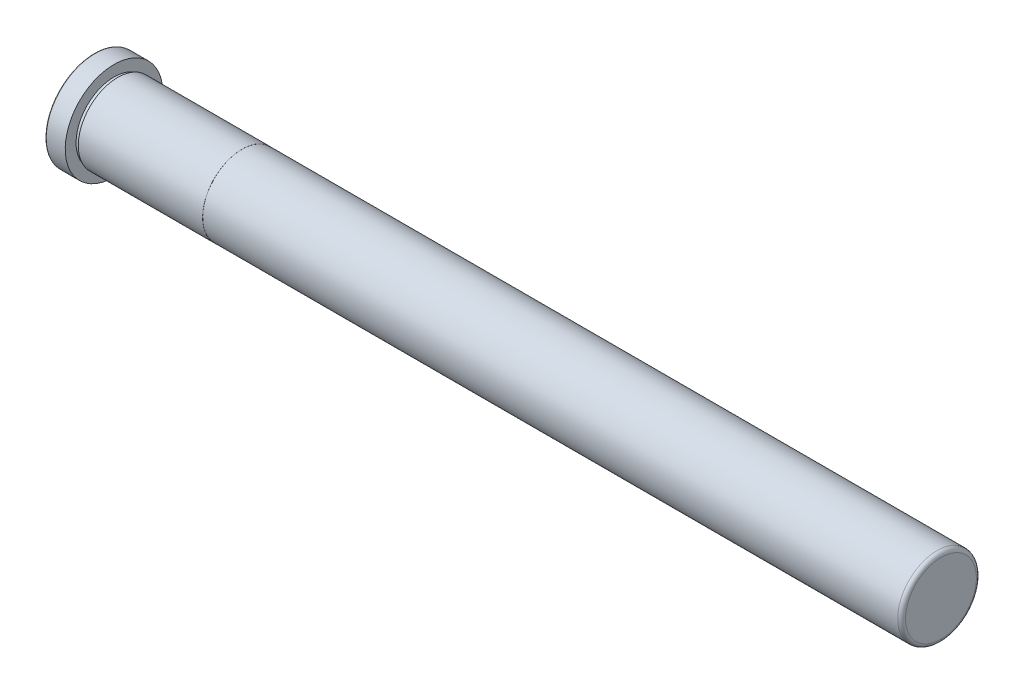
from build123d import *


with BuildPart() as part:
    # Sketch1 → Revolve1 (revolve)
    with BuildSketch(Plane.XY, mode=Mode.PRIVATE) as revolve1_sk:
        with BuildLine():
            Line((-1.6002, 0), (-1.6002, 15.494))
            ThreePointArc((-1.6002, 15.494), (-1.525805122, 15.673605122), (-1.3462, 15.748))
            Line((-1.3462, 15.748), (4.7498, 15.748))
            Line((4.7498, 15.748), (4.7498, 12.247245))
            Line((4.7498, 12.247245), (5.931516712, 12.247245))
            Line((5.931516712, 12.247245), (5.931516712, 12.7127))
            Line((5.931516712, 12.7127), (46.0248, 12.7127))
            Line((46.0248, 12.7127), (46.0248, 12.6873))
            Line((46.0248, 12.6873), (270.1798, 12.6873))
            ThreePointArc((270.1798, 12.6873), (271.077825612, 12.315325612), (271.4498, 11.4173))
            Line((271.4498, 11.4173), (271.4498, 0))
            Line((271.4498, 0), (-1.6002, 0))
        make_face()
    revolve(revolve1_sk.sketch.rotate(Axis((271.4498, 0, 0), (-1, 0, 0)), 180), axis=Axis((271.4498, 0, 0), (-1, 0, 0)))


solid = part.part
